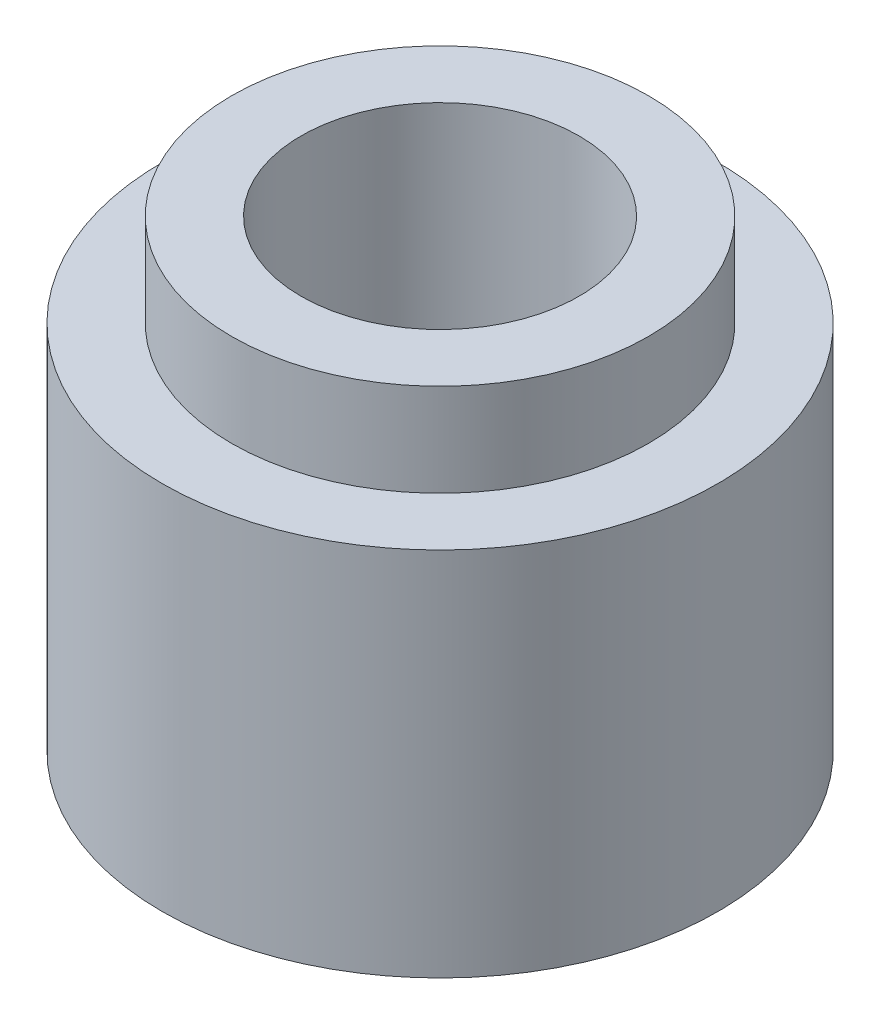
ISO-10303-21;
HEADER;
FILE_DESCRIPTION(('STEP AP214'),'2;1');
FILE_NAME('part.step','',(''),(''),'','','');
FILE_SCHEMA(('AUTOMOTIVE_DESIGN { 1 0 10303 214 1 1 1 1 }'));
ENDSEC;
DATA;
#1=APPLICATION_CONTEXT('core data for automotive mechanical design processes');
#2=APPLICATION_PROTOCOL_DEFINITION('international standard','automotive_design',2000,#1);
#3=PRODUCT_CONTEXT('',#1,'mechanical');
#4=PRODUCT('Part','Part','',(#3));
#5=PRODUCT_RELATED_PRODUCT_CATEGORY('part','',(#4));
#6=PRODUCT_DEFINITION_FORMATION('','',#4);
#7=PRODUCT_DEFINITION_CONTEXT('part definition',#1,'design');
#8=PRODUCT_DEFINITION('design','',#6,#7);
#9=PRODUCT_DEFINITION_SHAPE('','',#8);
#10=(LENGTH_UNIT() NAMED_UNIT(*) SI_UNIT(.MILLI.,.METRE.));
#11=(NAMED_UNIT(*) PLANE_ANGLE_UNIT() SI_UNIT($,.RADIAN.));
#12=(NAMED_UNIT(*) SI_UNIT($,.STERADIAN.) SOLID_ANGLE_UNIT());
#13=UNCERTAINTY_MEASURE_WITH_UNIT(LENGTH_MEASURE(1.E-05),#10,'distance_accuracy_value','');
#14=(GEOMETRIC_REPRESENTATION_CONTEXT(3) GLOBAL_UNCERTAINTY_ASSIGNED_CONTEXT((#13)) GLOBAL_UNIT_ASSIGNED_CONTEXT((#10,
#11,#12)) REPRESENTATION_CONTEXT('',''));
#15=CARTESIAN_POINT('',(0.,0.,0.));
#16=DIRECTION('',(0.,0.,1.));
#17=DIRECTION('',(1.,0.,0.));
#18=AXIS2_PLACEMENT_3D('',#15,#16,#17);
#19=CARTESIAN_POINT('',(0.,4.,0.));
#20=DIRECTION('',(0.,1.,0.));
#21=DIRECTION('',(0.,0.,1.));
#22=AXIS2_PLACEMENT_3D('',#19,#20,#21);
#23=PLANE('',#22);
#24=CARTESIAN_POINT('',(0.,4.,0.));
#25=DIRECTION('',(0.,1.,0.));
#26=DIRECTION('',(0.,0.,1.));
#27=AXIS2_PLACEMENT_3D('',#24,#25,#26);
#28=CIRCLE('',#27,3.);
#29=CARTESIAN_POINT('',(0.,4.,3.));
#30=VERTEX_POINT('',#29);
#31=EDGE_CURVE('E10',#30,#30,#28,.T.);
#32=ORIENTED_EDGE('',*,*,#31,.T.);
#33=EDGE_LOOP('',(#32));
#34=FACE_BOUND('',#33,.T.);
#35=CARTESIAN_POINT('',(0.,4.,0.));
#36=DIRECTION('',(0.,1.,0.));
#37=DIRECTION('',(0.,0.,1.));
#38=AXIS2_PLACEMENT_3D('',#35,#36,#37);
#39=CIRCLE('',#38,2.25);
#40=CARTESIAN_POINT('',(0.,4.,2.25));
#41=VERTEX_POINT('',#40);
#42=EDGE_CURVE('E42',#41,#41,#39,.T.);
#43=ORIENTED_EDGE('',*,*,#42,.F.);
#44=EDGE_LOOP('',(#43));
#45=FACE_BOUND('',#44,.T.);
#46=ADVANCED_FACE('F29',(#34,#45),#23,.T.);
#47=CARTESIAN_POINT('',(0.,4.,0.));
#48=DIRECTION('',(0.,-1.,0.));
#49=DIRECTION('',(0.,0.,-1.));
#50=AXIS2_PLACEMENT_3D('',#47,#48,#49);
#51=CYLINDRICAL_SURFACE('',#50,3.);
#52=ORIENTED_EDGE('',*,*,#31,.F.);
#53=EDGE_LOOP('',(#52));
#54=FACE_BOUND('',#53,.T.);
#55=CARTESIAN_POINT('',(0.,0.,0.));
#56=DIRECTION('',(0.,1.,0.));
#57=DIRECTION('',(0.,0.,1.));
#58=AXIS2_PLACEMENT_3D('',#55,#56,#57);
#59=CIRCLE('',#58,3.);
#60=CARTESIAN_POINT('',(0.,0.,3.));
#61=VERTEX_POINT('',#60);
#62=EDGE_CURVE('E33',#61,#61,#59,.T.);
#63=ORIENTED_EDGE('',*,*,#62,.T.);
#64=EDGE_LOOP('',(#63));
#65=FACE_BOUND('',#64,.T.);
#66=ADVANCED_FACE('F31',(#54,#65),#51,.T.);
#67=CARTESIAN_POINT('',(0.,0.,0.));
#68=DIRECTION('',(0.,1.,0.));
#69=DIRECTION('',(0.,0.,1.));
#70=AXIS2_PLACEMENT_3D('',#67,#68,#69);
#71=PLANE('',#70);
#72=CARTESIAN_POINT('',(0.,0.,0.));
#73=DIRECTION('',(0.,-1.,0.));
#74=DIRECTION('',(0.,0.,-1.));
#75=AXIS2_PLACEMENT_3D('',#72,#73,#74);
#76=CIRCLE('',#75,1.5);
#77=CARTESIAN_POINT('',(0.,0.,-1.5));
#78=VERTEX_POINT('',#77);
#79=EDGE_CURVE('E50',#78,#78,#76,.T.);
#80=ORIENTED_EDGE('',*,*,#79,.F.);
#81=EDGE_LOOP('',(#80));
#82=FACE_BOUND('',#81,.T.);
#83=ORIENTED_EDGE('',*,*,#62,.F.);
#84=EDGE_LOOP('',(#83));
#85=FACE_BOUND('',#84,.T.);
#86=ADVANCED_FACE('F57',(#82,#85),#71,.F.);
#87=CARTESIAN_POINT('',(0.,5.,0.));
#88=DIRECTION('',(0.,-1.,0.));
#89=DIRECTION('',(0.,0.,-1.));
#90=AXIS2_PLACEMENT_3D('',#87,#88,#89);
#91=CYLINDRICAL_SURFACE('',#90,2.25);
#92=CARTESIAN_POINT('',(0.,5.,0.));
#93=DIRECTION('',(0.,1.,0.));
#94=DIRECTION('',(0.,0.,1.));
#95=AXIS2_PLACEMENT_3D('',#92,#93,#94);
#96=CIRCLE('',#95,2.25);
#97=CARTESIAN_POINT('',(0.,5.,2.25));
#98=VERTEX_POINT('',#97);
#99=EDGE_CURVE('E40',#98,#98,#96,.T.);
#100=ORIENTED_EDGE('',*,*,#99,.F.);
#101=EDGE_LOOP('',(#100));
#102=FACE_BOUND('',#101,.T.);
#103=ORIENTED_EDGE('',*,*,#42,.T.);
#104=EDGE_LOOP('',(#103));
#105=FACE_BOUND('',#104,.T.);
#106=ADVANCED_FACE('F60',(#102,#105),#91,.T.);
#107=CARTESIAN_POINT('',(0.,5.,0.));
#108=DIRECTION('',(0.,1.,0.));
#109=DIRECTION('',(0.,0.,1.));
#110=AXIS2_PLACEMENT_3D('',#107,#108,#109);
#111=PLANE('',#110);
#112=CARTESIAN_POINT('',(0.,5.,0.));
#113=DIRECTION('',(0.,1.,0.));
#114=DIRECTION('',(0.,0.,1.));
#115=AXIS2_PLACEMENT_3D('',#112,#113,#114);
#116=CIRCLE('',#115,1.5);
#117=CARTESIAN_POINT('',(0.,5.,1.5));
#118=VERTEX_POINT('',#117);
#119=EDGE_CURVE('E45',#118,#118,#116,.F.);
#120=ORIENTED_EDGE('',*,*,#119,.T.);
#121=EDGE_LOOP('',(#120));
#122=FACE_BOUND('',#121,.T.);
#123=ORIENTED_EDGE('',*,*,#99,.T.);
#124=EDGE_LOOP('',(#123));
#125=FACE_BOUND('',#124,.T.);
#126=ADVANCED_FACE('F75',(#122,#125),#111,.T.);
#127=CARTESIAN_POINT('',(0.,9.24264068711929,0.));
#128=DIRECTION('',(0.,-1.,0.));
#129=DIRECTION('',(0.,0.,-1.));
#130=AXIS2_PLACEMENT_3D('',#127,#128,#129);
#131=CYLINDRICAL_SURFACE('',#130,1.5);
#132=ORIENTED_EDGE('',*,*,#79,.T.);
#133=EDGE_LOOP('',(#132));
#134=FACE_BOUND('',#133,.T.);
#135=ORIENTED_EDGE('',*,*,#119,.F.);
#136=EDGE_LOOP('',(#135));
#137=FACE_BOUND('',#136,.T.);
#138=ADVANCED_FACE('F54',(#134,#137),#131,.F.);
#139=CLOSED_SHELL('',(#46,#66,#86,#106,#126,#138));
#140=MANIFOLD_SOLID_BREP('B2',#139);
#141=ADVANCED_BREP_SHAPE_REPRESENTATION('',(#18,#140),#14);
#142=SHAPE_DEFINITION_REPRESENTATION(#9,#141);
ENDSEC;
END-ISO-10303-21;
